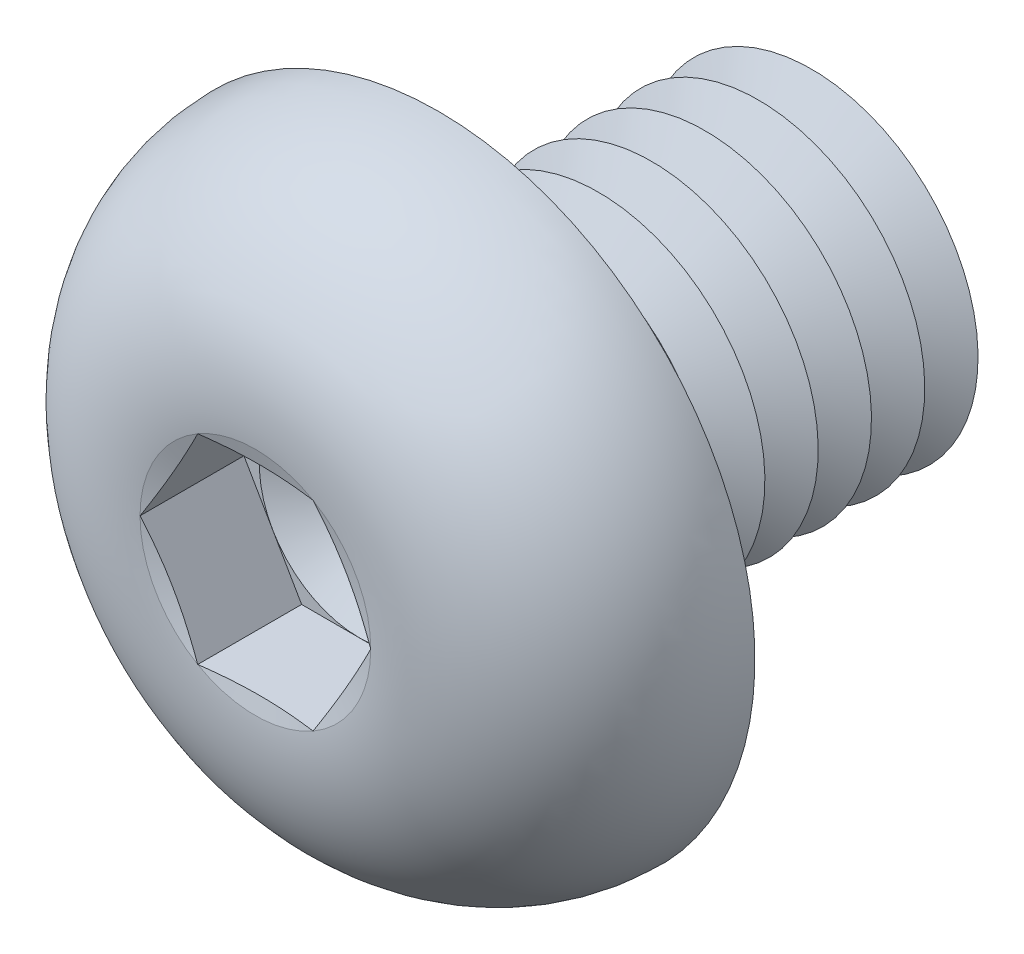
from build123d import *

# Parameters (mm, degrees)
FILLET1_R          = 0.4
LPATTERN1_COUNT    = 7
LPATTERN1_PITCH    = 0.8
CUT_EXTRUDE1_DEPTH = 1.56


with BuildPart() as part:
    # Sketch1 → Revolve1 (revolve)
    with BuildSketch(Plane(origin=(0, 0, 0), x_dir=(0, 0, -1), z_dir=(1, 0, 0))):
        with BuildLine():
            Line((0, 2.5), (0, 4.75))
            ThreePointArc((0, 4.75), (-2.041477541, 3.848329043), (-2.75, 1.73205))
            Line((-2.75, 1.73205), (-2.517949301, 0.866025))
            Line((-2.517949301, 0.866025), (-2.75, 0.866025))
            Line((-2.75, 0.866025), (-2.75, 0))
            Line((-2.75, 0), (6, 0))
            Line((6, 0), (6, 2.5))
            Line((6, 2.5), (0, 2.5))
        make_face()
    revolve(axis=Axis((0, 0, -6), (0, 0, 1)))

    # Fillet1
    fillet1_edges = [part.edges().sort_by_distance(p)[0] for p in [
        (0, -2.5, 0),
    ]]
    fillet(fillet1_edges, radius=FILLET1_R)

    # Sketch2 → Cut-Revolve1 (revolve, cut)
    with BuildSketch(Plane(origin=(0, 0, 0), x_dir=(0, 0, -1), z_dir=(1, 0, 0))):
        Polygon((5.6, 2.5), (6.4, 2.5), (6, 1.807179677), align=None)
    cut_revolve1 = revolve(axis=Axis((0, 0, -6), (0, 0, -1)), mode=Mode.SUBTRACT)

    # LPattern1: Cut-Revolve1 ×7
    with Locations(*[(0, 0, i * LPATTERN1_PITCH) for i in range(1, LPATTERN1_COUNT)]):
        add(cut_revolve1, mode=Mode.SUBTRACT)

    # Sketch3 → Cut-Extrude1 (cut)
    with BuildSketch(Plane.XY.offset(2.75)):
        Polygon((0.866025, 1.499999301), (-0.866025, 1.499999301), (-1.73205, 0), (-0.866025, -1.499999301), (0.866025, -1.499999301), (1.73205, 0), align=None)
    extrude(amount=-CUT_EXTRUDE1_DEPTH, mode=Mode.SUBTRACT)

    # Cut-Extrude2 cone 1 section (on through the dimple's axis) → Cut-Extrude2 (revolve, cut)
    with BuildSketch(Plane(origin=(0, 0, 1.19), x_dir=(0, -1, 0), z_dir=(1, 0, 0))):
        Polygon((0, 0), (1.499999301, 0), (0, 0.866025), align=None)
    revolve(axis=Axis((0, 0, 1.19), (0, 0, -1)), mode=Mode.SUBTRACT)


solid = part.part
